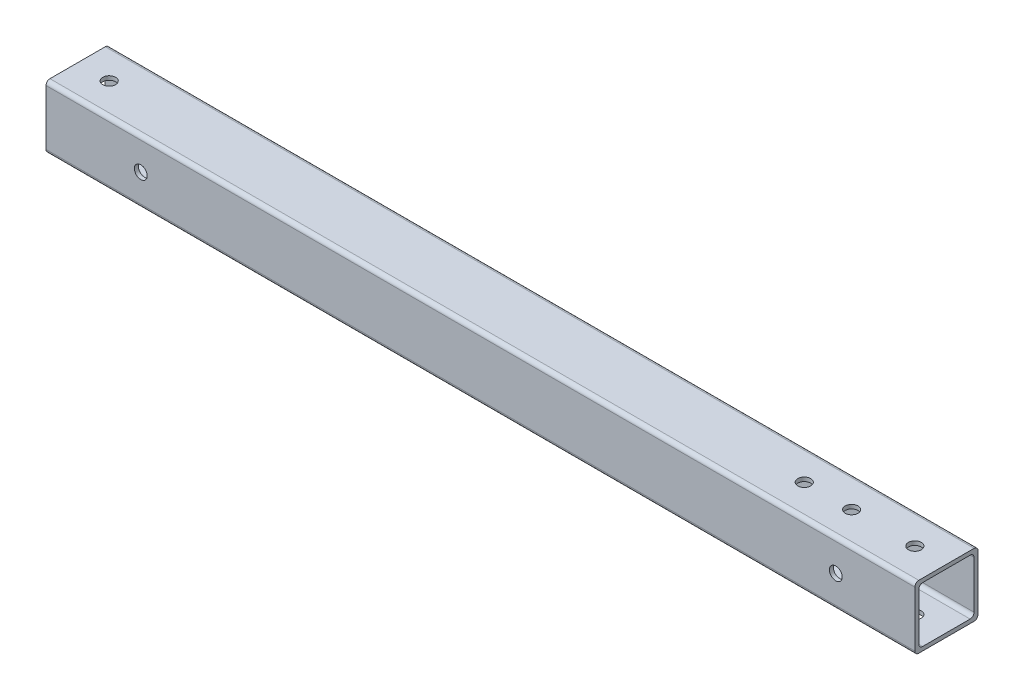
from build123d import *

# Parameters (mm, degrees)
SKETCH1_W          = 1397
SKETCH1_H          = 101.6
EXTRUDE1_DEPTH     = 101.6
CUT_EXTRUDE1_REACH = 1406.37
SKETCH2_W          = 88.9
SKETCH2_H          = 88.9
FILLET1_R          = 6.35
SKETCH3_R          = 10.31875
CUT_EXTRUDE2_DEPTH = 101.6
SKETCH4_R          = 10.31875
CUT_EXTRUDE3_DEPTH = 101.6
SKETCH5_R          = 10.31875
CUT_EXTRUDE4_DEPTH = 101.6
SKETCH6_R          = 10.31875
CUT_EXTRUDE5_DEPTH = 101.6
SKETCH7_R          = 10.31875
CUT_EXTRUDE6_DEPTH = 101.6
SKETCH8_R          = 10.31875
CUT_EXTRUDE7_DEPTH = 101.6


with BuildPart() as part:
    # Sketch1 → Extrude1 (new body)
    with BuildSketch(Plane(origin=(0, 0, 0), x_dir=(1, 0, 0), z_dir=(0, 1, 0))):
        with Locations((-698.5, -50.8)):
            Rectangle(SKETCH1_W, SKETCH1_H)
    extrude(amount=EXTRUDE1_DEPTH)

    # Sketch2 → Cut-Extrude1 (cut, up to next)
    with BuildSketch(Plane.ZY.offset(1397), mode=Mode.PRIVATE) as cut_extrude1_sk1:
        with Locations((50.8, 50.8)):
            Rectangle(SKETCH2_W, SKETCH2_H)
    cut_extrude1_tool1 = extrude(cut_extrude1_sk1.sketch, amount=-CUT_EXTRUDE1_REACH, mode=Mode.PRIVATE) & part.part
    add(cut_extrude1_tool1.solids().sort_by_distance((-1397, 50.8, 50.8))[0], mode=Mode.SUBTRACT)

    # Fillet1
    fillet1_edges = [part.edges().sort_by_distance(p)[0] for p in [
        (-698.5, 101.6, 101.6),
        (-698.5, 6.35, 6.35),
        (-698.5, 95.25, 6.35),
        (-698.5, 95.25, 95.25),
        (-698.5, 6.35, 95.25),
        (-698.5, 0, 101.6),
        (-698.5, 0, 0),
        (-698.5, 101.6, 0),
    ]]
    fillet(fillet1_edges, radius=FILLET1_R)

    # Sketch3 → Cut-Extrude2 (cut)
    with BuildSketch(Plane.XZ):
        with Locations(Location((-1346.2, 50.8, 0), (0, 0, 270))):
            Circle(SKETCH3_R)
    extrude(amount=-CUT_EXTRUDE2_DEPTH, mode=Mode.SUBTRACT)

    # Sketch4 → Cut-Extrude3 (cut)
    with BuildSketch(Plane(origin=(0, 0, 0), x_dir=(-1, 0, 0), z_dir=(0, 0, -1))):
        with Locations((1244.6, 50.8)):
            Circle(SKETCH4_R)
    extrude(amount=-CUT_EXTRUDE3_DEPTH, mode=Mode.SUBTRACT)

    # Sketch5 → Cut-Extrude4 (cut)
    with BuildSketch(Plane(origin=(0, 0, 0), x_dir=(-1, 0, 0), z_dir=(0, 0, -1))):
        with Locations((127, 50.8)):
            Circle(SKETCH5_R)
    extrude(amount=-CUT_EXTRUDE4_DEPTH, mode=Mode.SUBTRACT)

    # Sketch6 → Cut-Extrude5 (cut)
    with BuildSketch(Plane.XZ):
        with Locations(Location((-50.8, 50.8, 0), (0, 0, 270))):
            Circle(SKETCH6_R)
    extrude(amount=-CUT_EXTRUDE5_DEPTH, mode=Mode.SUBTRACT)

    # Sketch7 → Cut-Extrude6 (cut)
    with BuildSketch(Plane.XZ):
        with Locations(Location((-152.4, 50.8, 0), (0, 0, 270))):
            Circle(SKETCH7_R)
    extrude(amount=-CUT_EXTRUDE6_DEPTH, mode=Mode.SUBTRACT)

    # Sketch8 → Cut-Extrude7 (cut)
    with BuildSketch(Plane.XZ):
        with Locations(Location((-228.6, 50.8, 0), (0, 0, 270))):
            Circle(SKETCH8_R)
    extrude(amount=-CUT_EXTRUDE7_DEPTH, mode=Mode.SUBTRACT)


solid = part.part
